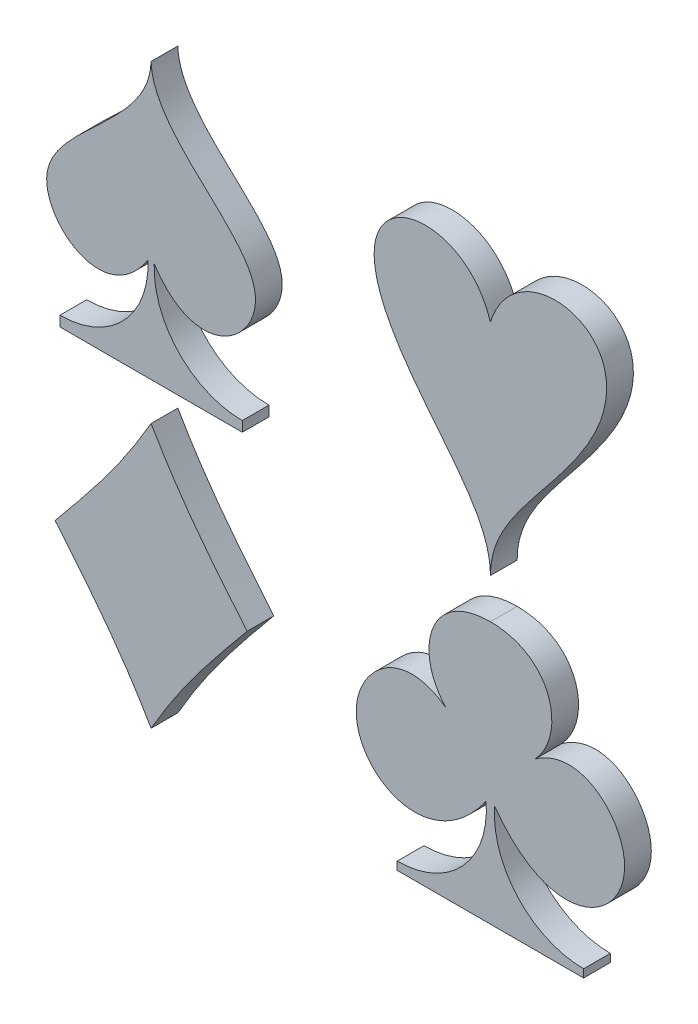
ISO-10303-21;
HEADER;
FILE_DESCRIPTION(('STEP AP214'),'2;1');
FILE_NAME('part.step','',(''),(''),'','','');
FILE_SCHEMA(('AUTOMOTIVE_DESIGN { 1 0 10303 214 1 1 1 1 }'));
ENDSEC;
DATA;
#1=APPLICATION_CONTEXT('core data for automotive mechanical design processes');
#2=APPLICATION_PROTOCOL_DEFINITION('international standard','automotive_design',2000,#1);
#3=PRODUCT_CONTEXT('',#1,'mechanical');
#4=PRODUCT('Part','Part','',(#3));
#5=PRODUCT_RELATED_PRODUCT_CATEGORY('part','',(#4));
#6=PRODUCT_DEFINITION_FORMATION('','',#4);
#7=PRODUCT_DEFINITION_CONTEXT('part definition',#1,'design');
#8=PRODUCT_DEFINITION('design','',#6,#7);
#9=PRODUCT_DEFINITION_SHAPE('','',#8);
#10=(LENGTH_UNIT() NAMED_UNIT(*) SI_UNIT(.MILLI.,.METRE.));
#11=(NAMED_UNIT(*) PLANE_ANGLE_UNIT() SI_UNIT($,.RADIAN.));
#12=(NAMED_UNIT(*) SI_UNIT($,.STERADIAN.) SOLID_ANGLE_UNIT());
#13=UNCERTAINTY_MEASURE_WITH_UNIT(LENGTH_MEASURE(1.E-05),#10,'distance_accuracy_value','');
#14=(GEOMETRIC_REPRESENTATION_CONTEXT(3) GLOBAL_UNCERTAINTY_ASSIGNED_CONTEXT((#13)) GLOBAL_UNIT_ASSIGNED_CONTEXT((#10,
#11,#12)) REPRESENTATION_CONTEXT('',''));
#15=CARTESIAN_POINT('',(0.,0.,0.));
#16=DIRECTION('',(0.,0.,1.));
#17=DIRECTION('',(1.,0.,0.));
#18=AXIS2_PLACEMENT_3D('',#15,#16,#17);
#19=CARTESIAN_POINT('',(75.207229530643,-45.536132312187,10.));
#20=CARTESIAN_POINT('',(87.4603010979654,-32.1706876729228,10.));
#21=CARTESIAN_POINT('',(81.5660539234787,-9.44140619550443,10.));
#22=CARTESIAN_POINT('',(58.4536299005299,-9.44140619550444,10.));
#23=B_SPLINE_CURVE_WITH_KNOTS('',3,(#19,#20,#21,#22),.UNSPECIFIED.,.F.,.F.,(4,4),(0.,1.),.UNSPECIFIED.);
#24=DIRECTION('',(0.,0.,-1.));
#25=VECTOR('',#24,1.);
#26=SURFACE_OF_LINEAR_EXTRUSION('',#23,#25);
#27=CARTESIAN_POINT('',(75.207229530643,-45.536132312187,0.));
#28=CARTESIAN_POINT('',(87.4603010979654,-32.1706876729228,0.));
#29=CARTESIAN_POINT('',(81.5660539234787,-9.44140619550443,0.));
#30=CARTESIAN_POINT('',(58.4536299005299,-9.44140619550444,0.));
#31=B_SPLINE_CURVE_WITH_KNOTS('',3,(#27,#28,#29,#30),.UNSPECIFIED.,.F.,.F.,(4,4),(0.,1.),.UNSPECIFIED.);
#32=CARTESIAN_POINT('',(75.207229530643,-45.536132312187,0.));
#33=VERTEX_POINT('',#32);
#34=CARTESIAN_POINT('',(58.4536299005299,-9.44140619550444,0.));
#35=VERTEX_POINT('',#34);
#36=EDGE_CURVE('E151',#33,#35,#31,.T.);
#37=ORIENTED_EDGE('',*,*,#36,.T.);
#38=DIRECTION('',(0.,0.,-1.));
#39=VECTOR('',#38,1.);
#40=CARTESIAN_POINT('',(58.4536299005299,-9.44140619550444,10.));
#41=LINE('',#40,#39);
#42=CARTESIAN_POINT('',(58.4536299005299,-9.44140619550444,10.));
#43=VERTEX_POINT('',#42);
#44=EDGE_CURVE('E12',#43,#35,#41,.T.);
#45=ORIENTED_EDGE('',*,*,#44,.F.);
#46=CARTESIAN_POINT('',(75.207229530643,-45.536132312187,10.));
#47=VERTEX_POINT('',#46);
#48=EDGE_CURVE('E247',#47,#43,#23,.T.);
#49=ORIENTED_EDGE('',*,*,#48,.F.);
#50=DIRECTION('',(0.,0.,-1.));
#51=VECTOR('',#50,1.);
#52=CARTESIAN_POINT('',(75.207229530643,-45.536132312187,10.));
#53=LINE('',#52,#51);
#54=EDGE_CURVE('E144',#47,#33,#53,.T.);
#55=ORIENTED_EDGE('',*,*,#54,.T.);
#56=EDGE_LOOP('',(#37,#45,#49,#55));
#57=FACE_BOUND('',#56,.T.);
#58=ADVANCED_FACE('F45',(#57),#26,.F.);
#59=CARTESIAN_POINT('',(58.4536299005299,-9.44140619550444,10.));
#60=CARTESIAN_POINT('',(35.3412058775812,-9.44140619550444,10.));
#61=CARTESIAN_POINT('',(29.4469587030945,-32.1706876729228,10.));
#62=CARTESIAN_POINT('',(41.7000302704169,-45.536132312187,10.));
#63=B_SPLINE_CURVE_WITH_KNOTS('',3,(#59,#60,#61,#62),.UNSPECIFIED.,.F.,.F.,(4,4),(0.,1.),.UNSPECIFIED.);
#64=DIRECTION('',(0.,0.,-1.));
#65=VECTOR('',#64,1.);
#66=SURFACE_OF_LINEAR_EXTRUSION('',#63,#65);
#67=CARTESIAN_POINT('',(58.4536299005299,-9.44140619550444,0.));
#68=CARTESIAN_POINT('',(35.3412058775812,-9.44140619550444,0.));
#69=CARTESIAN_POINT('',(29.4469587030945,-32.1706876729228,0.));
#70=CARTESIAN_POINT('',(41.7000302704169,-45.536132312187,0.));
#71=B_SPLINE_CURVE_WITH_KNOTS('',3,(#67,#68,#69,#70),.UNSPECIFIED.,.F.,.F.,(4,4),(0.,1.),.UNSPECIFIED.);
#72=CARTESIAN_POINT('',(41.7000302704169,-45.536132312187,0.));
#73=VERTEX_POINT('',#72);
#74=EDGE_CURVE('E228',#35,#73,#71,.T.);
#75=ORIENTED_EDGE('',*,*,#74,.T.);
#76=DIRECTION('',(0.,0.,-1.));
#77=VECTOR('',#76,1.);
#78=CARTESIAN_POINT('',(41.7000302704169,-45.536132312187,10.));
#79=LINE('',#78,#77);
#80=CARTESIAN_POINT('',(41.7000302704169,-45.536132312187,10.));
#81=VERTEX_POINT('',#80);
#82=EDGE_CURVE('E54',#81,#73,#79,.T.);
#83=ORIENTED_EDGE('',*,*,#82,.F.);
#84=EDGE_CURVE('E108',#43,#81,#63,.T.);
#85=ORIENTED_EDGE('',*,*,#84,.F.);
#86=ORIENTED_EDGE('',*,*,#44,.T.);
#87=EDGE_LOOP('',(#75,#83,#85,#86));
#88=FACE_BOUND('',#87,.T.);
#89=ADVANCED_FACE('F184',(#88),#66,.F.);
#90=CARTESIAN_POINT('',(41.7000302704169,-45.536132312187,10.));
#91=CARTESIAN_POINT('',(25.4088643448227,-33.9828681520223,10.));
#92=CARTESIAN_POINT('',(-12.9735235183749,-68.7905911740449,10.));
#93=CARTESIAN_POINT('',(33.8719466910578,-100.422829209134,10.));
#94=CARTESIAN_POINT('',(56.8445584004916,-68.4457452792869,10.));
#95=B_SPLINE_CURVE_WITH_KNOTS('',3,(#90,#91,#92,#93,#94),.UNSPECIFIED.,.F.,.F.,(4,1,4),(0.,
0.379375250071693,1.),.UNSPECIFIED.);
#96=DIRECTION('',(0.,0.,-1.));
#97=VECTOR('',#96,1.);
#98=SURFACE_OF_LINEAR_EXTRUSION('',#95,#97);
#99=CARTESIAN_POINT('',(41.7000302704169,-45.536132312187,0.));
#100=CARTESIAN_POINT('',(25.4088643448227,-33.9828681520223,0.));
#101=CARTESIAN_POINT('',(-12.9735235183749,-68.7905911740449,0.));
#102=CARTESIAN_POINT('',(33.8719466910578,-100.422829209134,0.));
#103=CARTESIAN_POINT('',(56.8445584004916,-68.4457452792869,0.));
#104=B_SPLINE_CURVE_WITH_KNOTS('',3,(#99,#100,#101,#102,#103),.UNSPECIFIED.,.F.,.F.,(4,1,4),(0.,
0.379375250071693,1.),.UNSPECIFIED.);
#105=CARTESIAN_POINT('',(56.8445584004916,-68.4457452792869,0.));
#106=VERTEX_POINT('',#105);
#107=EDGE_CURVE('E224',#73,#106,#104,.T.);
#108=ORIENTED_EDGE('',*,*,#107,.T.);
#109=DIRECTION('',(0.,0.,-1.));
#110=VECTOR('',#109,1.);
#111=CARTESIAN_POINT('',(56.8445584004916,-68.4457452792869,10.));
#112=LINE('',#111,#110);
#113=CARTESIAN_POINT('',(56.8445584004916,-68.4457452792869,10.));
#114=VERTEX_POINT('',#113);
#115=EDGE_CURVE('E218',#114,#106,#112,.T.);
#116=ORIENTED_EDGE('',*,*,#115,.F.);
#117=EDGE_CURVE('E187',#81,#114,#95,.T.);
#118=ORIENTED_EDGE('',*,*,#117,.F.);
#119=ORIENTED_EDGE('',*,*,#82,.T.);
#120=EDGE_LOOP('',(#108,#116,#118,#119));
#121=FACE_BOUND('',#120,.T.);
#122=ADVANCED_FACE('F180',(#121),#98,.F.);
#123=CARTESIAN_POINT('',(23.5634520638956,-71.0922721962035,10.));
#124=DIRECTION('',(0.,0.,-1.));
#125=DIRECTION('',(-1.,0.,0.));
#126=AXIS2_PLACEMENT_3D('',#123,#124,#125);
#127=CYLINDRICAL_SURFACE('',#126,33.3861669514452);
#128=CARTESIAN_POINT('',(23.5634520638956,-71.0922721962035,0.));
#129=DIRECTION('',(0.,0.,-1.));
#130=DIRECTION('',(1.,0.,0.));
#131=AXIS2_PLACEMENT_3D('',#128,#129,#130);
#132=CIRCLE('',#131,33.3861669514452);
#133=CARTESIAN_POINT('',(23.5634520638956,-104.478439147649,0.));
#134=VERTEX_POINT('',#133);
#135=EDGE_CURVE('E229',#106,#134,#132,.T.);
#136=ORIENTED_EDGE('',*,*,#135,.T.);
#137=DIRECTION('',(0.,0.,-1.));
#138=VECTOR('',#137,1.);
#139=CARTESIAN_POINT('',(23.5634520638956,-104.478439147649,10.));
#140=LINE('',#139,#138);
#141=CARTESIAN_POINT('',(23.5634520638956,-104.478439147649,10.));
#142=VERTEX_POINT('',#141);
#143=EDGE_CURVE('E211',#142,#134,#140,.T.);
#144=ORIENTED_EDGE('',*,*,#143,.F.);
#145=CARTESIAN_POINT('',(23.5634520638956,-71.0922721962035,10.));
#146=DIRECTION('',(0.,0.,-1.));
#147=DIRECTION('',(1.,0.,0.));
#148=AXIS2_PLACEMENT_3D('',#145,#146,#147);
#149=CIRCLE('',#148,33.3861669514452);
#150=EDGE_CURVE('E192',#114,#142,#149,.T.);
#151=ORIENTED_EDGE('',*,*,#150,.F.);
#152=ORIENTED_EDGE('',*,*,#115,.T.);
#153=EDGE_LOOP('',(#136,#144,#151,#152));
#154=FACE_BOUND('',#153,.T.);
#155=ADVANCED_FACE('F176',(#154),#127,.F.);
#156=CARTESIAN_POINT('',(23.5634520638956,-107.476836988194,10.));
#157=DIRECTION('',(1.,0.,0.));
#158=DIRECTION('',(0.,0.,-1.));
#159=AXIS2_PLACEMENT_3D('',#156,#157,#158);
#160=PLANE('',#159);
#161=DIRECTION('',(0.,-1.,0.));
#162=VECTOR('',#161,1.);
#163=CARTESIAN_POINT('',(23.5634520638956,-107.476836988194,0.));
#164=LINE('',#163,#162);
#165=CARTESIAN_POINT('',(23.5634520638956,-107.476836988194,0.));
#166=VERTEX_POINT('',#165);
#167=EDGE_CURVE('E209',#134,#166,#164,.T.);
#168=ORIENTED_EDGE('',*,*,#167,.T.);
#169=DIRECTION('',(0.,0.,-1.));
#170=VECTOR('',#169,1.);
#171=CARTESIAN_POINT('',(23.5634520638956,-107.476836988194,10.));
#172=LINE('',#171,#170);
#173=CARTESIAN_POINT('',(23.5634520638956,-107.476836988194,10.));
#174=VERTEX_POINT('',#173);
#175=EDGE_CURVE('E207',#174,#166,#172,.T.);
#176=ORIENTED_EDGE('',*,*,#175,.F.);
#177=DIRECTION('',(0.,-1.,0.));
#178=VECTOR('',#177,1.);
#179=CARTESIAN_POINT('',(23.5634520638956,-107.476836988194,10.));
#180=LINE('',#179,#178);
#181=EDGE_CURVE('E200',#142,#174,#180,.T.);
#182=ORIENTED_EDGE('',*,*,#181,.F.);
#183=ORIENTED_EDGE('',*,*,#143,.T.);
#184=EDGE_LOOP('',(#168,#176,#182,#183));
#185=FACE_BOUND('',#184,.T.);
#186=ADVANCED_FACE('F172',(#185),#160,.F.);
#187=CARTESIAN_POINT('',(93.3438077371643,-107.476836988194,10.));
#188=DIRECTION('',(0.,1.,0.));
#189=DIRECTION('',(0.,0.,1.));
#190=AXIS2_PLACEMENT_3D('',#187,#188,#189);
#191=PLANE('',#190);
#192=DIRECTION('',(1.,0.,0.));
#193=VECTOR('',#192,1.);
#194=CARTESIAN_POINT('',(93.3438077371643,-107.476836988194,0.));
#195=LINE('',#194,#193);
#196=CARTESIAN_POINT('',(93.3438077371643,-107.476836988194,0.));
#197=VERTEX_POINT('',#196);
#198=EDGE_CURVE('E213',#166,#197,#195,.T.);
#199=ORIENTED_EDGE('',*,*,#198,.T.);
#200=DIRECTION('',(0.,0.,-1.));
#201=VECTOR('',#200,1.);
#202=CARTESIAN_POINT('',(93.3438077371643,-107.476836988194,10.));
#203=LINE('',#202,#201);
#204=CARTESIAN_POINT('',(93.3438077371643,-107.476836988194,10.));
#205=VERTEX_POINT('',#204);
#206=EDGE_CURVE('E139',#205,#197,#203,.T.);
#207=ORIENTED_EDGE('',*,*,#206,.F.);
#208=DIRECTION('',(1.,0.,0.));
#209=VECTOR('',#208,1.);
#210=CARTESIAN_POINT('',(93.3438077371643,-107.476836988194,10.));
#211=LINE('',#210,#209);
#212=EDGE_CURVE('E130',#174,#205,#211,.T.);
#213=ORIENTED_EDGE('',*,*,#212,.F.);
#214=ORIENTED_EDGE('',*,*,#175,.T.);
#215=EDGE_LOOP('',(#199,#207,#213,#214));
#216=FACE_BOUND('',#215,.T.);
#217=ADVANCED_FACE('F169',(#216),#191,.F.);
#218=CARTESIAN_POINT('',(93.3438077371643,-107.476836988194,10.));
#219=DIRECTION('',(-1.,0.,0.));
#220=DIRECTION('',(0.,0.,1.));
#221=AXIS2_PLACEMENT_3D('',#218,#219,#220);
#222=PLANE('',#221);
#223=DIRECTION('',(0.,1.,0.));
#224=VECTOR('',#223,1.);
#225=CARTESIAN_POINT('',(93.3438077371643,-107.476836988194,0.));
#226=LINE('',#225,#224);
#227=CARTESIAN_POINT('',(93.3438077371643,-104.478439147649,0.));
#228=VERTEX_POINT('',#227);
#229=EDGE_CURVE('E138',#197,#228,#226,.T.);
#230=ORIENTED_EDGE('',*,*,#229,.T.);
#231=DIRECTION('',(0.,0.,-1.));
#232=VECTOR('',#231,1.);
#233=CARTESIAN_POINT('',(93.3438077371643,-104.478439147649,10.));
#234=LINE('',#233,#232);
#235=CARTESIAN_POINT('',(93.3438077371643,-104.478439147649,10.));
#236=VERTEX_POINT('',#235);
#237=EDGE_CURVE('E135',#236,#228,#234,.T.);
#238=ORIENTED_EDGE('',*,*,#237,.F.);
#239=DIRECTION('',(0.,1.,0.));
#240=VECTOR('',#239,1.);
#241=CARTESIAN_POINT('',(93.3438077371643,-107.476836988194,10.));
#242=LINE('',#241,#240);
#243=EDGE_CURVE('E124',#205,#236,#242,.T.);
#244=ORIENTED_EDGE('',*,*,#243,.F.);
#245=ORIENTED_EDGE('',*,*,#206,.T.);
#246=EDGE_LOOP('',(#230,#238,#244,#245));
#247=FACE_BOUND('',#246,.T.);
#248=ADVANCED_FACE('F136',(#247),#222,.F.);
#249=CARTESIAN_POINT('',(93.3438077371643,-71.0922721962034,10.));
#250=DIRECTION('',(0.,0.,-1.));
#251=DIRECTION('',(-1.,0.,0.));
#252=AXIS2_PLACEMENT_3D('',#249,#250,#251);
#253=CYLINDRICAL_SURFACE('',#252,33.3861669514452);
#254=CARTESIAN_POINT('',(93.3438077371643,-71.0922721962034,0.));
#255=DIRECTION('',(0.,0.,-1.));
#256=DIRECTION('',(-1.,0.,0.));
#257=AXIS2_PLACEMENT_3D('',#254,#255,#256);
#258=CIRCLE('',#257,33.3861669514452);
#259=CARTESIAN_POINT('',(60.0627014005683,-68.4457452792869,0.));
#260=VERTEX_POINT('',#259);
#261=EDGE_CURVE('E94',#228,#260,#258,.T.);
#262=ORIENTED_EDGE('',*,*,#261,.T.);
#263=DIRECTION('',(0.,0.,-1.));
#264=VECTOR('',#263,1.);
#265=CARTESIAN_POINT('',(60.0627014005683,-68.4457452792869,10.));
#266=LINE('',#265,#264);
#267=CARTESIAN_POINT('',(60.0627014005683,-68.4457452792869,10.));
#268=VERTEX_POINT('',#267);
#269=EDGE_CURVE('E140',#268,#260,#266,.T.);
#270=ORIENTED_EDGE('',*,*,#269,.F.);
#271=CARTESIAN_POINT('',(93.3438077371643,-71.0922721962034,10.));
#272=DIRECTION('',(0.,0.,-1.));
#273=DIRECTION('',(-1.,0.,0.));
#274=AXIS2_PLACEMENT_3D('',#271,#272,#273);
#275=CIRCLE('',#274,33.3861669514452);
#276=EDGE_CURVE('E128',#236,#268,#275,.T.);
#277=ORIENTED_EDGE('',*,*,#276,.F.);
#278=ORIENTED_EDGE('',*,*,#237,.T.);
#279=EDGE_LOOP('',(#262,#270,#277,#278));
#280=FACE_BOUND('',#279,.T.);
#281=ADVANCED_FACE('F142',(#280),#253,.F.);
#282=CARTESIAN_POINT('',(60.0627014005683,-68.4457452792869,10.));
#283=CARTESIAN_POINT('',(83.0353131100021,-100.422829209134,10.));
#284=CARTESIAN_POINT('',(129.880783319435,-68.7905911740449,10.));
#285=CARTESIAN_POINT('',(91.4983954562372,-33.9828681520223,10.));
#286=CARTESIAN_POINT('',(75.207229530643,-45.536132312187,10.));
#287=B_SPLINE_CURVE_WITH_KNOTS('',3,(#282,#283,#284,#285,#286),.UNSPECIFIED.,.F.,.F.,(4,1,4),
(0.,0.620624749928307,1.),.UNSPECIFIED.);
#288=DIRECTION('',(0.,0.,-1.));
#289=VECTOR('',#288,1.);
#290=SURFACE_OF_LINEAR_EXTRUSION('',#287,#289);
#291=CARTESIAN_POINT('',(60.0627014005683,-68.4457452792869,0.));
#292=CARTESIAN_POINT('',(83.0353131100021,-100.422829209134,0.));
#293=CARTESIAN_POINT('',(129.880783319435,-68.7905911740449,0.));
#294=CARTESIAN_POINT('',(91.4983954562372,-33.9828681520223,0.));
#295=CARTESIAN_POINT('',(75.207229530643,-45.536132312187,0.));
#296=B_SPLINE_CURVE_WITH_KNOTS('',3,(#291,#292,#293,#294,#295),.UNSPECIFIED.,.F.,.F.,(4,1,4),
(0.,0.620624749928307,1.),.UNSPECIFIED.);
#297=EDGE_CURVE('E100',#260,#33,#296,.T.);
#298=ORIENTED_EDGE('',*,*,#297,.T.);
#299=ORIENTED_EDGE('',*,*,#54,.F.);
#300=EDGE_CURVE('E62',#268,#47,#287,.T.);
#301=ORIENTED_EDGE('',*,*,#300,.F.);
#302=ORIENTED_EDGE('',*,*,#269,.T.);
#303=EDGE_LOOP('',(#298,#299,#301,#302));
#304=FACE_BOUND('',#303,.T.);
#305=ADVANCED_FACE('F159',(#304),#290,.F.);
#306=CARTESIAN_POINT('',(80.0924905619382,-22.4767275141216,10.));
#307=DIRECTION('',(0.,0.,-1.));
#308=DIRECTION('',(-1.,0.,0.));
#309=AXIS2_PLACEMENT_3D('',#306,#307,#308);
#310=PLANE('',#309);
#311=ORIENTED_EDGE('',*,*,#48,.T.);
#312=ORIENTED_EDGE('',*,*,#84,.T.);
#313=ORIENTED_EDGE('',*,*,#117,.T.);
#314=ORIENTED_EDGE('',*,*,#150,.T.);
#315=ORIENTED_EDGE('',*,*,#181,.T.);
#316=ORIENTED_EDGE('',*,*,#212,.T.);
#317=ORIENTED_EDGE('',*,*,#243,.T.);
#318=ORIENTED_EDGE('',*,*,#276,.T.);
#319=ORIENTED_EDGE('',*,*,#300,.T.);
#320=EDGE_LOOP('',(#311,#312,#313,#314,#315,#316,#317,#318,#319));
#321=FACE_BOUND('',#320,.T.);
#322=ADVANCED_FACE('F126',(#321),#310,.F.);
#323=CARTESIAN_POINT('',(80.0924905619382,-22.4767275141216,0.));
#324=DIRECTION('',(0.,0.,-1.));
#325=DIRECTION('',(-1.,0.,0.));
#326=AXIS2_PLACEMENT_3D('',#323,#324,#325);
#327=PLANE('',#326);
#328=ORIENTED_EDGE('',*,*,#36,.F.);
#329=ORIENTED_EDGE('',*,*,#297,.F.);
#330=ORIENTED_EDGE('',*,*,#261,.F.);
#331=ORIENTED_EDGE('',*,*,#229,.F.);
#332=ORIENTED_EDGE('',*,*,#198,.F.);
#333=ORIENTED_EDGE('',*,*,#167,.F.);
#334=ORIENTED_EDGE('',*,*,#135,.F.);
#335=ORIENTED_EDGE('',*,*,#107,.F.);
#336=ORIENTED_EDGE('',*,*,#74,.F.);
#337=EDGE_LOOP('',(#328,#329,#330,#331,#332,#333,#334,#335,#336));
#338=FACE_BOUND('',#337,.T.);
#339=ADVANCED_FACE('F163',(#338),#327,.T.);
#340=CLOSED_SHELL('',(#58,#89,#122,#155,#186,#217,#248,#281,#305,#322,#339));
#341=MANIFOLD_SOLID_BREP('B2',#340);
#342=CARTESIAN_POINT('',(58.4536299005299,5.55924389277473,10.));
#343=CARTESIAN_POINT('',(58.4536299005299,35.383962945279,10.));
#344=CARTESIAN_POINT('',(95.3019449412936,56.1575096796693,10.));
#345=CARTESIAN_POINT('',(148.225028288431,100.177644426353,10.));
#346=CARTESIAN_POINT('',(72.7972693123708,133.069093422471,10.));
#347=CARTESIAN_POINT('',(58.4536299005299,87.7673027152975,10.));
#348=B_SPLINE_CURVE_WITH_KNOTS('',5,(#342,#343,#344,#345,#346,#347),.UNSPECIFIED.,.F.,.F.,(6,6),
(0.,1.),.UNSPECIFIED.);
#349=DIRECTION('',(0.,0.,-1.));
#350=VECTOR('',#349,1.);
#351=SURFACE_OF_LINEAR_EXTRUSION('',#348,#350);
#352=CARTESIAN_POINT('',(58.4536299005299,5.55924389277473,0.));
#353=CARTESIAN_POINT('',(58.4536299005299,35.383962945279,0.));
#354=CARTESIAN_POINT('',(95.3019449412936,56.1575096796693,0.));
#355=CARTESIAN_POINT('',(148.225028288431,100.177644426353,0.));
#356=CARTESIAN_POINT('',(72.7972693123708,133.069093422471,0.));
#357=CARTESIAN_POINT('',(58.4536299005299,87.7673027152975,0.));
#358=B_SPLINE_CURVE_WITH_KNOTS('',5,(#352,#353,#354,#355,#356,#357),.UNSPECIFIED.,.F.,.F.,(6,6),
(0.,1.),.UNSPECIFIED.);
#359=CARTESIAN_POINT('',(58.4536299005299,5.55924389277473,0.));
#360=VERTEX_POINT('',#359);
#361=CARTESIAN_POINT('',(58.4536299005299,87.7673027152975,0.));
#362=VERTEX_POINT('',#361);
#363=EDGE_CURVE('E384',#360,#362,#358,.T.);
#364=ORIENTED_EDGE('',*,*,#363,.T.);
#365=DIRECTION('',(0.,0.,-1.));
#366=VECTOR('',#365,1.);
#367=CARTESIAN_POINT('',(58.4536299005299,87.7673027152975,10.));
#368=LINE('',#367,#366);
#369=CARTESIAN_POINT('',(58.4536299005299,87.7673027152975,10.));
#370=VERTEX_POINT('',#369);
#371=EDGE_CURVE('E43',#370,#362,#368,.T.);
#372=ORIENTED_EDGE('',*,*,#371,.F.);
#373=CARTESIAN_POINT('',(58.4536299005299,5.55924389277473,10.));
#374=VERTEX_POINT('',#373);
#375=EDGE_CURVE('E383',#374,#370,#348,.T.);
#376=ORIENTED_EDGE('',*,*,#375,.F.);
#377=DIRECTION('',(0.,0.,-1.));
#378=VECTOR('',#377,1.);
#379=CARTESIAN_POINT('',(58.4536299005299,5.55924389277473,10.));
#380=LINE('',#379,#378);
#381=EDGE_CURVE('E361',#374,#360,#380,.T.);
#382=ORIENTED_EDGE('',*,*,#381,.T.);
#383=EDGE_LOOP('',(#364,#372,#376,#382));
#384=FACE_BOUND('',#383,.T.);
#385=ADVANCED_FACE('F352',(#384),#351,.F.);
#386=CARTESIAN_POINT('',(58.4536299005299,87.7673027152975,10.));
#387=CARTESIAN_POINT('',(44.109990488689,133.069093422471,10.));
#388=CARTESIAN_POINT('',(-31.3177684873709,100.177644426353,10.));
#389=CARTESIAN_POINT('',(21.6053148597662,56.1575096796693,10.));
#390=CARTESIAN_POINT('',(58.4536299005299,35.383962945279,10.));
#391=CARTESIAN_POINT('',(58.4536299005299,5.55924389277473,10.));
#392=B_SPLINE_CURVE_WITH_KNOTS('',5,(#386,#387,#388,#389,#390,#391),.UNSPECIFIED.,.F.,.F.,(6,6),
(0.,1.),.UNSPECIFIED.);
#393=DIRECTION('',(0.,0.,-1.));
#394=VECTOR('',#393,1.);
#395=SURFACE_OF_LINEAR_EXTRUSION('',#392,#394);
#396=CARTESIAN_POINT('',(58.4536299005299,87.7673027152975,0.));
#397=CARTESIAN_POINT('',(44.109990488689,133.069093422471,0.));
#398=CARTESIAN_POINT('',(-31.3177684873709,100.177644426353,0.));
#399=CARTESIAN_POINT('',(21.6053148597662,56.1575096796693,0.));
#400=CARTESIAN_POINT('',(58.4536299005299,35.383962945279,0.));
#401=CARTESIAN_POINT('',(58.4536299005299,5.55924389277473,0.));
#402=B_SPLINE_CURVE_WITH_KNOTS('',5,(#396,#397,#398,#399,#400,#401),.UNSPECIFIED.,.F.,.F.,(6,6),
(0.,1.),.UNSPECIFIED.);
#403=EDGE_CURVE('E376',#362,#360,#402,.T.);
#404=ORIENTED_EDGE('',*,*,#403,.T.);
#405=ORIENTED_EDGE('',*,*,#381,.F.);
#406=EDGE_CURVE('E368',#370,#374,#392,.T.);
#407=ORIENTED_EDGE('',*,*,#406,.F.);
#408=ORIENTED_EDGE('',*,*,#371,.T.);
#409=EDGE_LOOP('',(#404,#405,#407,#408));
#410=FACE_BOUND('',#409,.T.);
#411=ADVANCED_FACE('F379',(#410),#395,.F.);
#412=CARTESIAN_POINT('',(100.263484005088,78.0919802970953,10.));
#413=DIRECTION('',(0.,0.,1.));
#414=DIRECTION('',(1.,0.,0.));
#415=AXIS2_PLACEMENT_3D('',#412,#413,#414);
#416=PLANE('',#415);
#417=ORIENTED_EDGE('',*,*,#375,.T.);
#418=ORIENTED_EDGE('',*,*,#406,.T.);
#419=EDGE_LOOP('',(#417,#418));
#420=FACE_BOUND('',#419,.T.);
#421=ADVANCED_FACE('F411',(#420),#416,.T.);
#422=CARTESIAN_POINT('',(100.263484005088,78.0919802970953,0.));
#423=DIRECTION('',(0.,0.,1.));
#424=DIRECTION('',(1.,0.,0.));
#425=AXIS2_PLACEMENT_3D('',#422,#423,#424);
#426=PLANE('',#425);
#427=ORIENTED_EDGE('',*,*,#363,.F.);
#428=ORIENTED_EDGE('',*,*,#403,.F.);
#429=EDGE_LOOP('',(#427,#428));
#430=FACE_BOUND('',#429,.T.);
#431=ADVANCED_FACE('F387',(#430),#426,.F.);
#432=CLOSED_SHELL('',(#385,#411,#421,#431));
#433=MANIFOLD_SOLID_BREP('B6',#432);
#434=CARTESIAN_POINT('',(-32.648352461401,-58.0729554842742,10.));
#435=CARTESIAN_POINT('',(-46.7068943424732,-41.0274279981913,10.));
#436=CARTESIAN_POINT('',(-57.1172842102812,-28.4922342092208,10.));
#437=CARTESIAN_POINT('',(-68.5775094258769,-8.66907398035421,10.));
#438=B_SPLINE_CURVE_WITH_KNOTS('',3,(#434,#435,#436,#437),.UNSPECIFIED.,.F.,.F.,(4,4),(0.,1.),.UNSPECIFIED.);
#439=DIRECTION('',(0.,0.,-1.));
#440=VECTOR('',#439,1.);
#441=SURFACE_OF_LINEAR_EXTRUSION('',#438,#440);
#442=CARTESIAN_POINT('',(-32.648352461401,-58.0729554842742,0.));
#443=CARTESIAN_POINT('',(-46.7068943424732,-41.0274279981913,0.));
#444=CARTESIAN_POINT('',(-57.1172842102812,-28.4922342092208,0.));
#445=CARTESIAN_POINT('',(-68.5775094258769,-8.66907398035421,0.));
#446=B_SPLINE_CURVE_WITH_KNOTS('',3,(#442,#443,#444,#445),.UNSPECIFIED.,.F.,.F.,(4,4),(0.,1.),.UNSPECIFIED.);
#447=CARTESIAN_POINT('',(-32.648352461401,-58.0729554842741,0.));
#448=VERTEX_POINT('',#447);
#449=CARTESIAN_POINT('',(-68.5775094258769,-8.66907398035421,0.));
#450=VERTEX_POINT('',#449);
#451=EDGE_CURVE('E543',#448,#450,#446,.T.);
#452=ORIENTED_EDGE('',*,*,#451,.T.);
#453=DIRECTION('',(0.,0.,-1.));
#454=VECTOR('',#453,1.);
#455=CARTESIAN_POINT('',(-68.5775094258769,-8.66907398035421,10.));
#456=LINE('',#455,#454);
#457=CARTESIAN_POINT('',(-68.5775094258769,-8.66907398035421,10.));
#458=VERTEX_POINT('',#457);
#459=EDGE_CURVE('E350',#458,#450,#456,.T.);
#460=ORIENTED_EDGE('',*,*,#459,.F.);
#461=CARTESIAN_POINT('',(-32.648352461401,-58.0729554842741,10.));
#462=VERTEX_POINT('',#461);
#463=EDGE_CURVE('E506',#462,#458,#438,.T.);
#464=ORIENTED_EDGE('',*,*,#463,.F.);
#465=DIRECTION('',(0.,0.,-1.));
#466=VECTOR('',#465,1.);
#467=CARTESIAN_POINT('',(-32.648352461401,-58.0729554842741,10.));
#468=LINE('',#467,#466);
#469=EDGE_CURVE('E514',#462,#448,#468,.T.);
#470=ORIENTED_EDGE('',*,*,#469,.T.);
#471=EDGE_LOOP('',(#452,#460,#464,#470));
#472=FACE_BOUND('',#471,.T.);
#473=ADVANCED_FACE('F454',(#472),#441,.F.);
#474=CARTESIAN_POINT('',(-68.5775094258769,-8.66907398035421,10.));
#475=CARTESIAN_POINT('',(-80.0377346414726,-28.4922342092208,10.));
#476=CARTESIAN_POINT('',(-90.4481245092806,-41.0274279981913,10.));
#477=CARTESIAN_POINT('',(-104.506666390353,-58.0729554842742,10.));
#478=B_SPLINE_CURVE_WITH_KNOTS('',3,(#474,#475,#476,#477),.UNSPECIFIED.,.F.,.F.,(4,4),(0.,1.),.UNSPECIFIED.);
#479=DIRECTION('',(0.,0.,-1.));
#480=VECTOR('',#479,1.);
#481=SURFACE_OF_LINEAR_EXTRUSION('',#478,#480);
#482=CARTESIAN_POINT('',(-68.5775094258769,-8.66907398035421,0.));
#483=CARTESIAN_POINT('',(-80.0377346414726,-28.4922342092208,0.));
#484=CARTESIAN_POINT('',(-90.4481245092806,-41.0274279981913,0.));
#485=CARTESIAN_POINT('',(-104.506666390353,-58.0729554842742,0.));
#486=B_SPLINE_CURVE_WITH_KNOTS('',3,(#482,#483,#484,#485),.UNSPECIFIED.,.F.,.F.,(4,4),(0.,1.),.UNSPECIFIED.);
#487=CARTESIAN_POINT('',(-104.506666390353,-58.0729554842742,0.));
#488=VERTEX_POINT('',#487);
#489=EDGE_CURVE('E510',#450,#488,#486,.T.);
#490=ORIENTED_EDGE('',*,*,#489,.T.);
#491=DIRECTION('',(0.,0.,-1.));
#492=VECTOR('',#491,1.);
#493=CARTESIAN_POINT('',(-104.506666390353,-58.0729554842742,10.));
#494=LINE('',#493,#492);
#495=CARTESIAN_POINT('',(-104.506666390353,-58.0729554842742,10.));
#496=VERTEX_POINT('',#495);
#497=EDGE_CURVE('E463',#496,#488,#494,.T.);
#498=ORIENTED_EDGE('',*,*,#497,.F.);
#499=EDGE_CURVE('E501',#458,#496,#478,.T.);
#500=ORIENTED_EDGE('',*,*,#499,.F.);
#501=ORIENTED_EDGE('',*,*,#459,.T.);
#502=EDGE_LOOP('',(#490,#498,#500,#501));
#503=FACE_BOUND('',#502,.T.);
#504=ADVANCED_FACE('F509',(#503),#481,.F.);
#505=CARTESIAN_POINT('',(-104.506666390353,-58.0729554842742,10.));
#506=CARTESIAN_POINT('',(-90.4481245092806,-75.1184829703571,10.));
#507=CARTESIAN_POINT('',(-80.0377346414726,-87.6536767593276,10.));
#508=CARTESIAN_POINT('',(-68.5775094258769,-107.476836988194,10.));
#509=B_SPLINE_CURVE_WITH_KNOTS('',3,(#505,#506,#507,#508),.UNSPECIFIED.,.F.,.F.,(4,4),(0.,1.),.UNSPECIFIED.);
#510=DIRECTION('',(0.,0.,-1.));
#511=VECTOR('',#510,1.);
#512=SURFACE_OF_LINEAR_EXTRUSION('',#509,#511);
#513=CARTESIAN_POINT('',(-104.506666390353,-58.0729554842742,0.));
#514=CARTESIAN_POINT('',(-90.4481245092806,-75.1184829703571,0.));
#515=CARTESIAN_POINT('',(-80.0377346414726,-87.6536767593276,0.));
#516=CARTESIAN_POINT('',(-68.5775094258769,-107.476836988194,0.));
#517=B_SPLINE_CURVE_WITH_KNOTS('',3,(#513,#514,#515,#516),.UNSPECIFIED.,.F.,.F.,(4,4),(0.,1.),.UNSPECIFIED.);
#518=CARTESIAN_POINT('',(-68.5775094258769,-107.476836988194,0.));
#519=VERTEX_POINT('',#518);
#520=EDGE_CURVE('E488',#488,#519,#517,.T.);
#521=ORIENTED_EDGE('',*,*,#520,.T.);
#522=DIRECTION('',(0.,0.,-1.));
#523=VECTOR('',#522,1.);
#524=CARTESIAN_POINT('',(-68.5775094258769,-107.476836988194,10.));
#525=LINE('',#524,#523);
#526=CARTESIAN_POINT('',(-68.5775094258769,-107.476836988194,10.));
#527=VERTEX_POINT('',#526);
#528=EDGE_CURVE('E511',#527,#519,#525,.T.);
#529=ORIENTED_EDGE('',*,*,#528,.F.);
#530=EDGE_CURVE('E504',#496,#527,#509,.T.);
#531=ORIENTED_EDGE('',*,*,#530,.F.);
#532=ORIENTED_EDGE('',*,*,#497,.T.);
#533=EDGE_LOOP('',(#521,#529,#531,#532));
#534=FACE_BOUND('',#533,.T.);
#535=ADVANCED_FACE('F512',(#534),#512,.F.);
#536=CARTESIAN_POINT('',(-68.5775094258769,-107.476836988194,10.));
#537=CARTESIAN_POINT('',(-57.1172842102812,-87.6536767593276,10.));
#538=CARTESIAN_POINT('',(-46.7068943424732,-75.1184829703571,10.));
#539=CARTESIAN_POINT('',(-32.648352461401,-58.0729554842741,10.));
#540=B_SPLINE_CURVE_WITH_KNOTS('',3,(#536,#537,#538,#539),.UNSPECIFIED.,.F.,.F.,(4,4),(0.,1.),.UNSPECIFIED.);
#541=DIRECTION('',(0.,0.,-1.));
#542=VECTOR('',#541,1.);
#543=SURFACE_OF_LINEAR_EXTRUSION('',#540,#542);
#544=CARTESIAN_POINT('',(-68.5775094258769,-107.476836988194,0.));
#545=CARTESIAN_POINT('',(-57.1172842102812,-87.6536767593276,0.));
#546=CARTESIAN_POINT('',(-46.7068943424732,-75.1184829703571,0.));
#547=CARTESIAN_POINT('',(-32.648352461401,-58.0729554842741,0.));
#548=B_SPLINE_CURVE_WITH_KNOTS('',3,(#544,#545,#546,#547),.UNSPECIFIED.,.F.,.F.,(4,4),(0.,1.),.UNSPECIFIED.);
#549=EDGE_CURVE('E494',#519,#448,#548,.T.);
#550=ORIENTED_EDGE('',*,*,#549,.T.);
#551=ORIENTED_EDGE('',*,*,#469,.F.);
#552=EDGE_CURVE('E471',#527,#462,#540,.T.);
#553=ORIENTED_EDGE('',*,*,#552,.F.);
#554=ORIENTED_EDGE('',*,*,#528,.T.);
#555=EDGE_LOOP('',(#550,#551,#553,#554));
#556=FACE_BOUND('',#555,.T.);
#557=ADVANCED_FACE('F532',(#556),#543,.F.);
#558=CARTESIAN_POINT('',(-51.5872996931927,-34.4126270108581,10.));
#559=DIRECTION('',(0.,0.,-1.));
#560=DIRECTION('',(-1.,0.,0.));
#561=AXIS2_PLACEMENT_3D('',#558,#559,#560);
#562=PLANE('',#561);
#563=ORIENTED_EDGE('',*,*,#463,.T.);
#564=ORIENTED_EDGE('',*,*,#499,.T.);
#565=ORIENTED_EDGE('',*,*,#530,.T.);
#566=ORIENTED_EDGE('',*,*,#552,.T.);
#567=EDGE_LOOP('',(#563,#564,#565,#566));
#568=FACE_BOUND('',#567,.T.);
#569=ADVANCED_FACE('F502',(#568),#562,.F.);
#570=CARTESIAN_POINT('',(-51.5872996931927,-34.4126270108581,0.));
#571=DIRECTION('',(0.,0.,-1.));
#572=DIRECTION('',(-1.,0.,0.));
#573=AXIS2_PLACEMENT_3D('',#570,#571,#572);
#574=PLANE('',#573);
#575=ORIENTED_EDGE('',*,*,#451,.F.);
#576=ORIENTED_EDGE('',*,*,#549,.F.);
#577=ORIENTED_EDGE('',*,*,#520,.F.);
#578=ORIENTED_EDGE('',*,*,#489,.F.);
#579=EDGE_LOOP('',(#575,#576,#577,#578));
#580=FACE_BOUND('',#579,.T.);
#581=ADVANCED_FACE('F570',(#580),#574,.T.);
#582=CLOSED_SHELL('',(#473,#504,#535,#557,#569,#581));
#583=MANIFOLD_SOLID_BREP('B37',#582);
#584=CARTESIAN_POINT('',(-67.4104110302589,43.6984550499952,10.));
#585=CARTESIAN_POINT('',(-51.1899428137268,19.1358766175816,10.));
#586=CARTESIAN_POINT('',(-0.580737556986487,58.0526103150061,10.));
#587=CARTESIAN_POINT('',(-67.8996278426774,85.9552207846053,10.));
#588=CARTESIAN_POINT('',(-68.5775094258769,108.71454847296,10.));
#589=B_SPLINE_CURVE_WITH_KNOTS('',3,(#584,#585,#586,#587,#588),.UNSPECIFIED.,.F.,.F.,(4,1,4),
(0.,0.458370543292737,1.),.UNSPECIFIED.);
#590=DIRECTION('',(0.,0.,-1.));
#591=VECTOR('',#590,1.);
#592=SURFACE_OF_LINEAR_EXTRUSION('',#589,#591);
#593=CARTESIAN_POINT('',(-67.4104110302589,43.6984550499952,0.));
#594=CARTESIAN_POINT('',(-51.1899428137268,19.1358766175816,0.));
#595=CARTESIAN_POINT('',(-0.580737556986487,58.0526103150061,0.));
#596=CARTESIAN_POINT('',(-67.8996278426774,85.9552207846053,0.));
#597=CARTESIAN_POINT('',(-68.5775094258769,108.71454847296,0.));
#598=B_SPLINE_CURVE_WITH_KNOTS('',3,(#593,#594,#595,#596,#597),.UNSPECIFIED.,.F.,.F.,(4,1,4),
(0.,0.458370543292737,1.),.UNSPECIFIED.);
#599=CARTESIAN_POINT('',(-67.4104110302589,43.6984550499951,0.));
#600=VERTEX_POINT('',#599);
#601=CARTESIAN_POINT('',(-68.5775094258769,108.71454847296,0.));
#602=VERTEX_POINT('',#601);
#603=EDGE_CURVE('E712',#600,#602,#598,.T.);
#604=ORIENTED_EDGE('',*,*,#603,.T.);
#605=DIRECTION('',(0.,0.,-1.));
#606=VECTOR('',#605,1.);
#607=CARTESIAN_POINT('',(-68.5775094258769,108.71454847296,10.));
#608=LINE('',#607,#606);
#609=CARTESIAN_POINT('',(-68.5775094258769,108.71454847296,10.));
#610=VERTEX_POINT('',#609);
#611=EDGE_CURVE('E452',#610,#602,#608,.T.);
#612=ORIENTED_EDGE('',*,*,#611,.F.);
#613=CARTESIAN_POINT('',(-67.4104110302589,43.6984550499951,10.));
#614=VERTEX_POINT('',#613);
#615=EDGE_CURVE('E734',#614,#610,#589,.T.);
#616=ORIENTED_EDGE('',*,*,#615,.F.);
#617=DIRECTION('',(0.,0.,-1.));
#618=VECTOR('',#617,1.);
#619=CARTESIAN_POINT('',(-67.4104110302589,43.6984550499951,10.));
#620=LINE('',#619,#618);
#621=EDGE_CURVE('E708',#614,#600,#620,.T.);
#622=ORIENTED_EDGE('',*,*,#621,.T.);
#623=EDGE_LOOP('',(#604,#612,#616,#622));
#624=FACE_BOUND('',#623,.T.);
#625=ADVANCED_FACE('F621',(#624),#592,.F.);
#626=CARTESIAN_POINT('',(-68.5775094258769,108.71454847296,10.));
#627=CARTESIAN_POINT('',(-69.2553910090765,85.9552207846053,10.));
#628=CARTESIAN_POINT('',(-136.574281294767,58.0526103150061,10.));
#629=CARTESIAN_POINT('',(-85.9650760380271,19.1358766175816,10.));
#630=CARTESIAN_POINT('',(-69.744607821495,43.6984550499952,10.));
#631=B_SPLINE_CURVE_WITH_KNOTS('',3,(#626,#627,#628,#629,#630),.UNSPECIFIED.,.F.,.F.,(4,1,4),
(0.,0.541629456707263,1.),.UNSPECIFIED.);
#632=DIRECTION('',(0.,0.,-1.));
#633=VECTOR('',#632,1.);
#634=SURFACE_OF_LINEAR_EXTRUSION('',#631,#633);
#635=CARTESIAN_POINT('',(-68.5775094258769,108.71454847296,0.));
#636=CARTESIAN_POINT('',(-69.2553910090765,85.9552207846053,0.));
#637=CARTESIAN_POINT('',(-136.574281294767,58.0526103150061,0.));
#638=CARTESIAN_POINT('',(-85.9650760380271,19.1358766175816,0.));
#639=CARTESIAN_POINT('',(-69.744607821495,43.6984550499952,0.));
#640=B_SPLINE_CURVE_WITH_KNOTS('',3,(#635,#636,#637,#638,#639),.UNSPECIFIED.,.F.,.F.,(4,1,4),
(0.,0.541629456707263,1.),.UNSPECIFIED.);
#641=CARTESIAN_POINT('',(-69.744607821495,43.6984550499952,0.));
#642=VERTEX_POINT('',#641);
#643=EDGE_CURVE('E717',#602,#642,#640,.T.);
#644=ORIENTED_EDGE('',*,*,#643,.T.);
#645=DIRECTION('',(0.,0.,-1.));
#646=VECTOR('',#645,1.);
#647=CARTESIAN_POINT('',(-69.744607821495,43.6984550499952,10.));
#648=LINE('',#647,#646);
#649=CARTESIAN_POINT('',(-69.744607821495,43.6984550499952,10.));
#650=VERTEX_POINT('',#649);
#651=EDGE_CURVE('E630',#650,#642,#648,.T.);
#652=ORIENTED_EDGE('',*,*,#651,.F.);
#653=EDGE_CURVE('E678',#610,#650,#631,.T.);
#654=ORIENTED_EDGE('',*,*,#653,.F.);
#655=ORIENTED_EDGE('',*,*,#611,.T.);
#656=EDGE_LOOP('',(#644,#652,#654,#655));
#657=FACE_BOUND('',#656,.T.);
#658=ADVANCED_FACE('F764',(#657),#634,.F.);
#659=CARTESIAN_POINT('',(-102.729735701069,42.3698813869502,10.));
#660=DIRECTION('',(0.,0.,-1.));
#661=DIRECTION('',(-1.,0.,0.));
#662=AXIS2_PLACEMENT_3D('',#659,#660,#661);
#663=CYLINDRICAL_SURFACE('',#662,33.0118731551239);
#664=CARTESIAN_POINT('',(-102.729735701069,42.3698813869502,0.));
#665=DIRECTION('',(0.,0.,-1.));
#666=DIRECTION('',(1.,0.,0.));
#667=AXIS2_PLACEMENT_3D('',#664,#665,#666);
#668=CIRCLE('',#667,33.0118731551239);
#669=CARTESIAN_POINT('',(-102.729735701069,9.35800823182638,0.));
#670=VERTEX_POINT('',#669);
#671=EDGE_CURVE('E724',#642,#670,#668,.T.);
#672=ORIENTED_EDGE('',*,*,#671,.T.);
#673=DIRECTION('',(0.,0.,-1.));
#674=VECTOR('',#673,1.);
#675=CARTESIAN_POINT('',(-102.729735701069,9.35800823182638,10.));
#676=LINE('',#675,#674);
#677=CARTESIAN_POINT('',(-102.729735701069,9.35800823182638,10.));
#678=VERTEX_POINT('',#677);
#679=EDGE_CURVE('E738',#678,#670,#676,.T.);
#680=ORIENTED_EDGE('',*,*,#679,.F.);
#681=CARTESIAN_POINT('',(-102.729735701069,42.3698813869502,10.));
#682=DIRECTION('',(0.,0.,-1.));
#683=DIRECTION('',(1.,0.,0.));
#684=AXIS2_PLACEMENT_3D('',#681,#682,#683);
#685=CIRCLE('',#684,33.0118731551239);
#686=EDGE_CURVE('E746',#650,#678,#685,.T.);
#687=ORIENTED_EDGE('',*,*,#686,.F.);
#688=ORIENTED_EDGE('',*,*,#651,.T.);
#689=EDGE_LOOP('',(#672,#680,#687,#688));
#690=FACE_BOUND('',#689,.T.);
#691=ADVANCED_FACE('F744',(#690),#663,.F.);
#692=CARTESIAN_POINT('',(-102.729735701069,5.55924389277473,10.));
#693=DIRECTION('',(1.,0.,0.));
#694=DIRECTION('',(0.,0.,-1.));
#695=AXIS2_PLACEMENT_3D('',#692,#693,#694);
#696=PLANE('',#695);
#697=DIRECTION('',(0.,-1.,0.));
#698=VECTOR('',#697,1.);
#699=CARTESIAN_POINT('',(-102.729735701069,5.55924389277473,0.));
#700=LINE('',#699,#698);
#701=CARTESIAN_POINT('',(-102.729735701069,5.55924389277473,0.));
#702=VERTEX_POINT('',#701);
#703=EDGE_CURVE('E729',#670,#702,#700,.T.);
#704=ORIENTED_EDGE('',*,*,#703,.T.);
#705=DIRECTION('',(0.,0.,-1.));
#706=VECTOR('',#705,1.);
#707=CARTESIAN_POINT('',(-102.729735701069,5.55924389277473,10.));
#708=LINE('',#707,#706);
#709=CARTESIAN_POINT('',(-102.729735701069,5.55924389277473,10.));
#710=VERTEX_POINT('',#709);
#711=EDGE_CURVE('E703',#710,#702,#708,.T.);
#712=ORIENTED_EDGE('',*,*,#711,.F.);
#713=DIRECTION('',(0.,-1.,0.));
#714=VECTOR('',#713,1.);
#715=CARTESIAN_POINT('',(-102.729735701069,5.55924389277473,10.));
#716=LINE('',#715,#714);
#717=EDGE_CURVE('E694',#678,#710,#716,.T.);
#718=ORIENTED_EDGE('',*,*,#717,.F.);
#719=ORIENTED_EDGE('',*,*,#679,.T.);
#720=EDGE_LOOP('',(#704,#712,#718,#719));
#721=FACE_BOUND('',#720,.T.);
#722=ADVANCED_FACE('F752',(#721),#696,.F.);
#723=CARTESIAN_POINT('',(-34.4252831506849,5.55924389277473,10.));
#724=DIRECTION('',(0.,1.,0.));
#725=DIRECTION('',(0.,0.,1.));
#726=AXIS2_PLACEMENT_3D('',#723,#724,#725);
#727=PLANE('',#726);
#728=DIRECTION('',(1.,0.,0.));
#729=VECTOR('',#728,1.);
#730=CARTESIAN_POINT('',(-34.4252831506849,5.55924389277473,0.));
#731=LINE('',#730,#729);
#732=CARTESIAN_POINT('',(-34.4252831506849,5.55924389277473,0.));
#733=VERTEX_POINT('',#732);
#734=EDGE_CURVE('E702',#702,#733,#731,.T.);
#735=ORIENTED_EDGE('',*,*,#734,.T.);
#736=DIRECTION('',(0.,0.,-1.));
#737=VECTOR('',#736,1.);
#738=CARTESIAN_POINT('',(-34.4252831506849,5.55924389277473,10.));
#739=LINE('',#738,#737);
#740=CARTESIAN_POINT('',(-34.4252831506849,5.55924389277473,10.));
#741=VERTEX_POINT('',#740);
#742=EDGE_CURVE('E699',#741,#733,#739,.T.);
#743=ORIENTED_EDGE('',*,*,#742,.F.);
#744=DIRECTION('',(1.,0.,0.));
#745=VECTOR('',#744,1.);
#746=CARTESIAN_POINT('',(-34.4252831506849,5.55924389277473,10.));
#747=LINE('',#746,#745);
#748=EDGE_CURVE('E688',#710,#741,#747,.T.);
#749=ORIENTED_EDGE('',*,*,#748,.F.);
#750=ORIENTED_EDGE('',*,*,#711,.T.);
#751=EDGE_LOOP('',(#735,#743,#749,#750));
#752=FACE_BOUND('',#751,.T.);
#753=ADVANCED_FACE('F700',(#752),#727,.F.);
#754=CARTESIAN_POINT('',(-34.4252831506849,5.55924389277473,10.));
#755=DIRECTION('',(-1.,0.,0.));
#756=DIRECTION('',(0.,0.,1.));
#757=AXIS2_PLACEMENT_3D('',#754,#755,#756);
#758=PLANE('',#757);
#759=DIRECTION('',(0.,1.,0.));
#760=VECTOR('',#759,1.);
#761=CARTESIAN_POINT('',(-34.4252831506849,5.55924389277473,0.));
#762=LINE('',#761,#760);
#763=CARTESIAN_POINT('',(-34.4252831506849,9.35800823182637,0.));
#764=VERTEX_POINT('',#763);
#765=EDGE_CURVE('E664',#733,#764,#762,.T.);
#766=ORIENTED_EDGE('',*,*,#765,.T.);
#767=DIRECTION('',(0.,0.,-1.));
#768=VECTOR('',#767,1.);
#769=CARTESIAN_POINT('',(-34.4252831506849,9.35800823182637,10.));
#770=LINE('',#769,#768);
#771=CARTESIAN_POINT('',(-34.4252831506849,9.35800823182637,10.));
#772=VERTEX_POINT('',#771);
#773=EDGE_CURVE('E704',#772,#764,#770,.T.);
#774=ORIENTED_EDGE('',*,*,#773,.F.);
#775=DIRECTION('',(0.,1.,0.));
#776=VECTOR('',#775,1.);
#777=CARTESIAN_POINT('',(-34.4252831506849,5.55924389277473,10.));
#778=LINE('',#777,#776);
#779=EDGE_CURVE('E692',#741,#772,#778,.T.);
#780=ORIENTED_EDGE('',*,*,#779,.F.);
#781=ORIENTED_EDGE('',*,*,#742,.T.);
#782=EDGE_LOOP('',(#766,#774,#780,#781));
#783=FACE_BOUND('',#782,.T.);
#784=ADVANCED_FACE('F706',(#783),#758,.F.);
#785=CARTESIAN_POINT('',(-34.4252831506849,42.3698813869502,10.));
#786=DIRECTION('',(0.,0.,-1.));
#787=DIRECTION('',(-1.,0.,0.));
#788=AXIS2_PLACEMENT_3D('',#785,#786,#787);
#789=CYLINDRICAL_SURFACE('',#788,33.0118731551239);
#790=CARTESIAN_POINT('',(-34.4252831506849,42.3698813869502,0.));
#791=DIRECTION('',(0.,0.,-1.));
#792=DIRECTION('',(-1.,0.,0.));
#793=AXIS2_PLACEMENT_3D('',#790,#791,#792);
#794=CIRCLE('',#793,33.0118731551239);
#795=EDGE_CURVE('E670',#764,#600,#794,.T.);
#796=ORIENTED_EDGE('',*,*,#795,.T.);
#797=ORIENTED_EDGE('',*,*,#621,.F.);
#798=CARTESIAN_POINT('',(-34.4252831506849,42.3698813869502,10.));
#799=DIRECTION('',(0.,0.,-1.));
#800=DIRECTION('',(-1.,0.,0.));
#801=AXIS2_PLACEMENT_3D('',#798,#799,#800);
#802=CIRCLE('',#801,33.0118731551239);
#803=EDGE_CURVE('E638',#772,#614,#802,.T.);
#804=ORIENTED_EDGE('',*,*,#803,.F.);
#805=ORIENTED_EDGE('',*,*,#773,.T.);
#806=EDGE_LOOP('',(#796,#797,#804,#805));
#807=FACE_BOUND('',#806,.T.);
#808=ADVANCED_FACE('F775',(#807),#789,.F.);
#809=CARTESIAN_POINT('',(-30.5829844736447,56.6757572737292,10.));
#810=DIRECTION('',(0.,0.,-1.));
#811=DIRECTION('',(-1.,0.,0.));
#812=AXIS2_PLACEMENT_3D('',#809,#810,#811);
#813=PLANE('',#812);
#814=ORIENTED_EDGE('',*,*,#615,.T.);
#815=ORIENTED_EDGE('',*,*,#653,.T.);
#816=ORIENTED_EDGE('',*,*,#686,.T.);
#817=ORIENTED_EDGE('',*,*,#717,.T.);
#818=ORIENTED_EDGE('',*,*,#748,.T.);
#819=ORIENTED_EDGE('',*,*,#779,.T.);
#820=ORIENTED_EDGE('',*,*,#803,.T.);
#821=EDGE_LOOP('',(#814,#815,#816,#817,#818,#819,#820));
#822=FACE_BOUND('',#821,.T.);
#823=ADVANCED_FACE('F690',(#822),#813,.F.);
#824=CARTESIAN_POINT('',(-30.5829844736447,56.6757572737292,0.));
#825=DIRECTION('',(0.,0.,-1.));
#826=DIRECTION('',(-1.,0.,0.));
#827=AXIS2_PLACEMENT_3D('',#824,#825,#826);
#828=PLANE('',#827);
#829=ORIENTED_EDGE('',*,*,#603,.F.);
#830=ORIENTED_EDGE('',*,*,#795,.F.);
#831=ORIENTED_EDGE('',*,*,#765,.F.);
#832=ORIENTED_EDGE('',*,*,#734,.F.);
#833=ORIENTED_EDGE('',*,*,#703,.F.);
#834=ORIENTED_EDGE('',*,*,#671,.F.);
#835=ORIENTED_EDGE('',*,*,#643,.F.);
#836=EDGE_LOOP('',(#829,#830,#831,#832,#833,#834,#835));
#837=FACE_BOUND('',#836,.T.);
#838=ADVANCED_FACE('F750',(#837),#828,.T.);
#839=CLOSED_SHELL('',(#625,#658,#691,#722,#753,#784,#808,#823,#838));
#840=MANIFOLD_SOLID_BREP('B344',#839);
#841=ADVANCED_BREP_SHAPE_REPRESENTATION('',(#18,#341,#433,#583,#840),#14);
#842=SHAPE_DEFINITION_REPRESENTATION(#9,#841);
ENDSEC;
END-ISO-10303-21;
